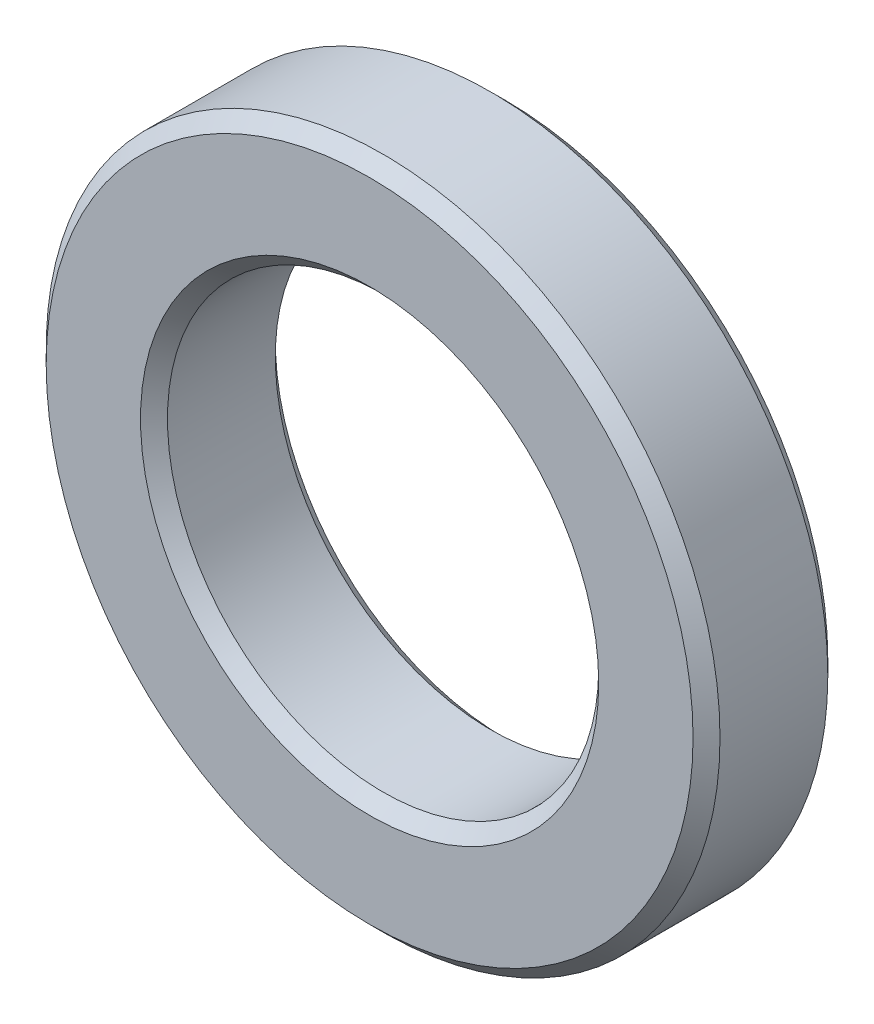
from build123d import *

# Parameters (mm, degrees)
SKETCH1_R           = 5
SKETCH1_R_2         = 3.2
BOSS_EXTRUDE2_DEPTH = 1
CHAMFER3_SIZE       = 0.2


with BuildPart() as part:
    # Sketch1 → Boss-Extrude2 (new, symmetric)
    with BuildSketch(Plane.XY):
        Circle(SKETCH1_R)
        Circle(SKETCH1_R_2, mode=Mode.SUBTRACT)
    extrude(amount=BOSS_EXTRUDE2_DEPTH, both=True)

    # Chamfer3
    chamfer3_edges = [part.edges().sort_by_distance(p)[0] for p in [
        (-5, 0, -1),
        (-5, 0, 1),
        (-3.2, 0, -1),
        (-3.2, 0, 1),
    ]]
    chamfer(chamfer3_edges, length=CHAMFER3_SIZE)


solid = part.part
